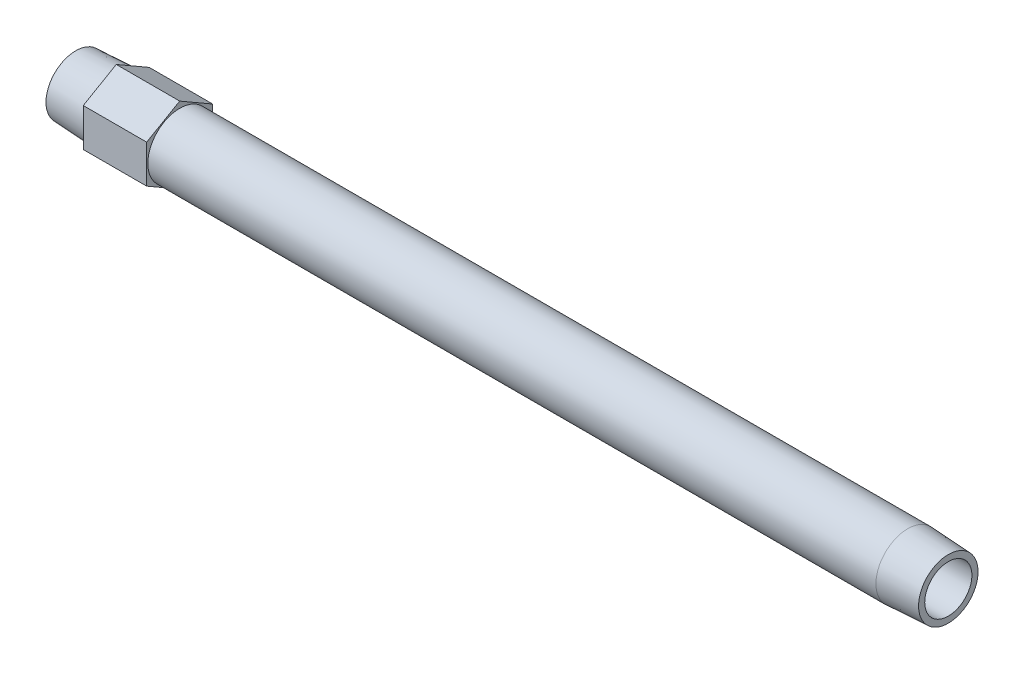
ISO-10303-21;
HEADER;
FILE_DESCRIPTION(('STEP AP214'),'2;1');
FILE_NAME('part.step','',(''),(''),'','','');
FILE_SCHEMA(('AUTOMOTIVE_DESIGN { 1 0 10303 214 1 1 1 1 }'));
ENDSEC;
DATA;
#1=APPLICATION_CONTEXT('core data for automotive mechanical design processes');
#2=APPLICATION_PROTOCOL_DEFINITION('international standard','automotive_design',2000,#1);
#3=PRODUCT_CONTEXT('',#1,'mechanical');
#4=PRODUCT('Part','Part','',(#3));
#5=PRODUCT_RELATED_PRODUCT_CATEGORY('part','',(#4));
#6=PRODUCT_DEFINITION_FORMATION('','',#4);
#7=PRODUCT_DEFINITION_CONTEXT('part definition',#1,'design');
#8=PRODUCT_DEFINITION('design','',#6,#7);
#9=PRODUCT_DEFINITION_SHAPE('','',#8);
#10=(LENGTH_UNIT() NAMED_UNIT(*) SI_UNIT(.MILLI.,.METRE.));
#11=(NAMED_UNIT(*) PLANE_ANGLE_UNIT() SI_UNIT($,.RADIAN.));
#12=(NAMED_UNIT(*) SI_UNIT($,.STERADIAN.) SOLID_ANGLE_UNIT());
#13=UNCERTAINTY_MEASURE_WITH_UNIT(LENGTH_MEASURE(1.E-05),#10,'distance_accuracy_value','');
#14=(GEOMETRIC_REPRESENTATION_CONTEXT(3) GLOBAL_UNCERTAINTY_ASSIGNED_CONTEXT((#13)) GLOBAL_UNIT_ASSIGNED_CONTEXT((#10,
#11,#12)) REPRESENTATION_CONTEXT('',''));
#15=CARTESIAN_POINT('',(0.,0.,0.));
#16=DIRECTION('',(0.,0.,1.));
#17=DIRECTION('',(1.,0.,0.));
#18=AXIS2_PLACEMENT_3D('',#15,#16,#17);
#19=CARTESIAN_POINT('',(0.,0.,-9.95716184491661));
#20=DIRECTION('',(1.,0.,0.));
#21=DIRECTION('',(0.,0.,-1.));
#22=AXIS2_PLACEMENT_3D('',#19,#20,#21);
#23=PLANE('',#22);
#24=CARTESIAN_POINT('',(0.,0.,0.));
#25=DIRECTION('',(-1.,0.,0.));
#26=DIRECTION('',(0.,0.,1.));
#27=AXIS2_PLACEMENT_3D('',#24,#25,#26);
#28=CIRCLE('',#27,9.95716184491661);
#29=CARTESIAN_POINT('',(0.,0.,9.95716184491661));
#30=VERTEX_POINT('',#29);
#31=EDGE_CURVE('E147',#30,#30,#28,.T.);
#32=ORIENTED_EDGE('',*,*,#31,.T.);
#33=EDGE_LOOP('',(#32));
#34=FACE_BOUND('',#33,.T.);
#35=CARTESIAN_POINT('',(0.,0.,0.));
#36=DIRECTION('',(1.,0.,0.));
#37=DIRECTION('',(0.,0.,1.));
#38=AXIS2_PLACEMENT_3D('',#35,#36,#37);
#39=CIRCLE('',#38,7.8994);
#40=CARTESIAN_POINT('',(0.,0.,7.8994));
#41=VERTEX_POINT('',#40);
#42=EDGE_CURVE('E159',#41,#41,#39,.T.);
#43=ORIENTED_EDGE('',*,*,#42,.T.);
#44=EDGE_LOOP('',(#43));
#45=FACE_BOUND('',#44,.T.);
#46=ADVANCED_FACE('F15',(#34,#45),#23,.F.);
#47=CARTESIAN_POINT('',(292.1,0.,-9.95716184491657));
#48=DIRECTION('',(-1.,0.,0.));
#49=DIRECTION('',(0.,0.,1.));
#50=AXIS2_PLACEMENT_3D('',#47,#48,#49);
#51=PLANE('',#50);
#52=CARTESIAN_POINT('',(292.1,0.,0.));
#53=DIRECTION('',(-1.,0.,0.));
#54=DIRECTION('',(0.,0.,1.));
#55=AXIS2_PLACEMENT_3D('',#52,#53,#54);
#56=CIRCLE('',#55,9.95716184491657);
#57=CARTESIAN_POINT('',(292.1,0.,9.95716184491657));
#58=VERTEX_POINT('',#57);
#59=EDGE_CURVE('E150',#58,#58,#56,.T.);
#60=ORIENTED_EDGE('',*,*,#59,.F.);
#61=EDGE_LOOP('',(#60));
#62=FACE_BOUND('',#61,.T.);
#63=CARTESIAN_POINT('',(292.1,0.,0.));
#64=DIRECTION('',(-1.,0.,0.));
#65=DIRECTION('',(0.,0.,1.));
#66=AXIS2_PLACEMENT_3D('',#63,#64,#65);
#67=CIRCLE('',#66,7.8994);
#68=CARTESIAN_POINT('',(292.1,0.,7.8994));
#69=VERTEX_POINT('',#68);
#70=EDGE_CURVE('E156',#69,#69,#67,.F.);
#71=ORIENTED_EDGE('',*,*,#70,.F.);
#72=EDGE_LOOP('',(#71));
#73=FACE_BOUND('',#72,.T.);
#74=ADVANCED_FACE('F178',(#62,#73),#51,.F.);
#75=CARTESIAN_POINT('',(34.798,-6.37914312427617,-11.049));
#76=DIRECTION('',(1.,0.,0.));
#77=DIRECTION('',(0.,1.,0.));
#78=AXIS2_PLACEMENT_3D('',#75,#76,#77);
#79=PLANE('',#78);
#80=DIRECTION('',(0.,0.5,-0.866025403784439));
#81=VECTOR('',#80,1.);
#82=CARTESIAN_POINT('',(34.798,-12.7582862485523,0.));
#83=LINE('',#82,#81);
#84=CARTESIAN_POINT('',(34.798,-12.7582862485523,0.));
#85=VERTEX_POINT('',#84);
#86=CARTESIAN_POINT('',(34.798,-6.37914312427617,-11.049));
#87=VERTEX_POINT('',#86);
#88=EDGE_CURVE('E103',#85,#87,#83,.T.);
#89=ORIENTED_EDGE('',*,*,#88,.T.);
#90=DIRECTION('',(0.,1.,0.));
#91=VECTOR('',#90,1.);
#92=CARTESIAN_POINT('',(34.798,-6.37914312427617,-11.049));
#93=LINE('',#92,#91);
#94=CARTESIAN_POINT('',(34.798,6.37914312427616,-11.049));
#95=VERTEX_POINT('',#94);
#96=EDGE_CURVE('E83',#87,#95,#93,.T.);
#97=ORIENTED_EDGE('',*,*,#96,.T.);
#98=DIRECTION('',(0.,0.5,0.866025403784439));
#99=VECTOR('',#98,1.);
#100=CARTESIAN_POINT('',(34.798,6.37914312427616,-11.049));
#101=LINE('',#100,#99);
#102=CARTESIAN_POINT('',(34.798,12.7582862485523,0.));
#103=VERTEX_POINT('',#102);
#104=EDGE_CURVE('E102',#95,#103,#101,.T.);
#105=ORIENTED_EDGE('',*,*,#104,.T.);
#106=DIRECTION('',(0.,-0.5,0.866025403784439));
#107=VECTOR('',#106,1.);
#108=CARTESIAN_POINT('',(34.798,12.7582862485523,0.));
#109=LINE('',#108,#107);
#110=CARTESIAN_POINT('',(34.798,6.37914312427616,11.049));
#111=VERTEX_POINT('',#110);
#112=EDGE_CURVE('E105',#103,#111,#109,.T.);
#113=ORIENTED_EDGE('',*,*,#112,.T.);
#114=DIRECTION('',(0.,-1.,0.));
#115=VECTOR('',#114,1.);
#116=CARTESIAN_POINT('',(34.798,6.37914312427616,11.049));
#117=LINE('',#116,#115);
#118=CARTESIAN_POINT('',(34.798,-6.37914312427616,11.049));
#119=VERTEX_POINT('',#118);
#120=EDGE_CURVE('E35',#111,#119,#117,.T.);
#121=ORIENTED_EDGE('',*,*,#120,.T.);
#122=DIRECTION('',(0.,-0.5,-0.866025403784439));
#123=VECTOR('',#122,1.);
#124=CARTESIAN_POINT('',(34.798,-6.37914312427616,11.049));
#125=LINE('',#124,#123);
#126=EDGE_CURVE('E30',#119,#85,#125,.T.);
#127=ORIENTED_EDGE('',*,*,#126,.T.);
#128=EDGE_LOOP('',(#89,#97,#105,#113,#121,#127));
#129=FACE_BOUND('',#128,.T.);
#130=CARTESIAN_POINT('',(34.798,0.,0.));
#131=DIRECTION('',(1.,0.,0.));
#132=DIRECTION('',(0.,1.,0.));
#133=AXIS2_PLACEMENT_3D('',#130,#131,#132);
#134=CIRCLE('',#133,10.668);
#135=CARTESIAN_POINT('',(34.798,10.668,0.));
#136=VERTEX_POINT('',#135);
#137=EDGE_CURVE('E89',#136,#136,#134,.F.);
#138=ORIENTED_EDGE('',*,*,#137,.T.);
#139=EDGE_LOOP('',(#138));
#140=FACE_BOUND('',#139,.T.);
#141=ADVANCED_FACE('F124',(#129,#140),#79,.T.);
#142=CARTESIAN_POINT('',(13.5636,-6.37914312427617,-11.049));
#143=DIRECTION('',(1.,0.,0.));
#144=DIRECTION('',(0.,1.,0.));
#145=AXIS2_PLACEMENT_3D('',#142,#143,#144);
#146=PLANE('',#145);
#147=DIRECTION('',(0.,0.5,-0.866025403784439));
#148=VECTOR('',#147,1.);
#149=CARTESIAN_POINT('',(13.5636,-12.7582862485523,0.));
#150=LINE('',#149,#148);
#151=CARTESIAN_POINT('',(13.5636,-12.7582862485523,0.));
#152=VERTEX_POINT('',#151);
#153=CARTESIAN_POINT('',(13.5636,-6.37914312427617,-11.049));
#154=VERTEX_POINT('',#153);
#155=EDGE_CURVE('E73',#152,#154,#150,.T.);
#156=ORIENTED_EDGE('',*,*,#155,.F.);
#157=DIRECTION('',(0.,-0.5,-0.866025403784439));
#158=VECTOR('',#157,1.);
#159=CARTESIAN_POINT('',(13.5636,-6.37914312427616,11.049));
#160=LINE('',#159,#158);
#161=CARTESIAN_POINT('',(13.5636,-6.37914312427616,11.049));
#162=VERTEX_POINT('',#161);
#163=EDGE_CURVE('E99',#162,#152,#160,.T.);
#164=ORIENTED_EDGE('',*,*,#163,.F.);
#165=DIRECTION('',(0.,-1.,0.));
#166=VECTOR('',#165,1.);
#167=CARTESIAN_POINT('',(13.5636,6.37914312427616,11.049));
#168=LINE('',#167,#166);
#169=CARTESIAN_POINT('',(13.5636,6.37914312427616,11.049));
#170=VERTEX_POINT('',#169);
#171=EDGE_CURVE('E133',#170,#162,#168,.T.);
#172=ORIENTED_EDGE('',*,*,#171,.F.);
#173=DIRECTION('',(0.,-0.5,0.866025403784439));
#174=VECTOR('',#173,1.);
#175=CARTESIAN_POINT('',(13.5636,12.7582862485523,0.));
#176=LINE('',#175,#174);
#177=CARTESIAN_POINT('',(13.5636,12.7582862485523,0.));
#178=VERTEX_POINT('',#177);
#179=EDGE_CURVE('E129',#178,#170,#176,.T.);
#180=ORIENTED_EDGE('',*,*,#179,.F.);
#181=DIRECTION('',(0.,0.5,0.866025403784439));
#182=VECTOR('',#181,1.);
#183=CARTESIAN_POINT('',(13.5636,6.37914312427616,-11.049));
#184=LINE('',#183,#182);
#185=CARTESIAN_POINT('',(13.5636,6.37914312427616,-11.049));
#186=VERTEX_POINT('',#185);
#187=EDGE_CURVE('E75',#186,#178,#184,.T.);
#188=ORIENTED_EDGE('',*,*,#187,.F.);
#189=DIRECTION('',(0.,1.,0.));
#190=VECTOR('',#189,1.);
#191=CARTESIAN_POINT('',(13.5636,-6.37914312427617,-11.049));
#192=LINE('',#191,#190);
#193=EDGE_CURVE('E68',#154,#186,#192,.T.);
#194=ORIENTED_EDGE('',*,*,#193,.F.);
#195=EDGE_LOOP('',(#156,#164,#172,#180,#188,#194));
#196=FACE_BOUND('',#195,.T.);
#197=CARTESIAN_POINT('',(13.5636,0.,0.));
#198=DIRECTION('',(-1.,0.,0.));
#199=DIRECTION('',(0.,0.,1.));
#200=AXIS2_PLACEMENT_3D('',#197,#198,#199);
#201=CIRCLE('',#200,10.668);
#202=CARTESIAN_POINT('',(13.5636,0.,10.668));
#203=VERTEX_POINT('',#202);
#204=EDGE_CURVE('E95',#203,#203,#201,.T.);
#205=ORIENTED_EDGE('',*,*,#204,.F.);
#206=EDGE_LOOP('',(#205));
#207=FACE_BOUND('',#206,.T.);
#208=ADVANCED_FACE('F69',(#196,#207),#146,.F.);
#209=CARTESIAN_POINT('',(34.798,-12.7582862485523,0.));
#210=DIRECTION('',(0.,0.866025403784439,0.5));
#211=DIRECTION('',(0.,-0.5,0.866025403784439));
#212=AXIS2_PLACEMENT_3D('',#209,#210,#211);
#213=PLANE('',#212);
#214=ORIENTED_EDGE('',*,*,#155,.T.);
#215=DIRECTION('',(-1.,0.,0.));
#216=VECTOR('',#215,1.);
#217=CARTESIAN_POINT('',(34.798,-6.37914312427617,-11.049));
#218=LINE('',#217,#216);
#219=EDGE_CURVE('E10',#87,#154,#218,.T.);
#220=ORIENTED_EDGE('',*,*,#219,.F.);
#221=ORIENTED_EDGE('',*,*,#88,.F.);
#222=DIRECTION('',(-1.,0.,0.));
#223=VECTOR('',#222,1.);
#224=CARTESIAN_POINT('',(34.798,-12.7582862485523,0.));
#225=LINE('',#224,#223);
#226=EDGE_CURVE('E87',#85,#152,#225,.T.);
#227=ORIENTED_EDGE('',*,*,#226,.T.);
#228=EDGE_LOOP('',(#214,#220,#221,#227));
#229=FACE_BOUND('',#228,.T.);
#230=ADVANCED_FACE('F17',(#229),#213,.F.);
#231=CARTESIAN_POINT('',(34.798,-6.37914312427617,-11.049));
#232=DIRECTION('',(0.,0.,1.));
#233=DIRECTION('',(1.,0.,0.));
#234=AXIS2_PLACEMENT_3D('',#231,#232,#233);
#235=PLANE('',#234);
#236=ORIENTED_EDGE('',*,*,#193,.T.);
#237=DIRECTION('',(-1.,0.,0.));
#238=VECTOR('',#237,1.);
#239=CARTESIAN_POINT('',(34.798,6.37914312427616,-11.049));
#240=LINE('',#239,#238);
#241=EDGE_CURVE('E23',#95,#186,#240,.T.);
#242=ORIENTED_EDGE('',*,*,#241,.F.);
#243=ORIENTED_EDGE('',*,*,#96,.F.);
#244=ORIENTED_EDGE('',*,*,#219,.T.);
#245=EDGE_LOOP('',(#236,#242,#243,#244));
#246=FACE_BOUND('',#245,.T.);
#247=ADVANCED_FACE('F82',(#246),#235,.F.);
#248=CARTESIAN_POINT('',(34.798,6.37914312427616,-11.049));
#249=DIRECTION('',(0.,-0.866025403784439,0.5));
#250=DIRECTION('',(0.,-0.5,-0.866025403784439));
#251=AXIS2_PLACEMENT_3D('',#248,#249,#250);
#252=PLANE('',#251);
#253=ORIENTED_EDGE('',*,*,#187,.T.);
#254=DIRECTION('',(-1.,0.,0.));
#255=VECTOR('',#254,1.);
#256=CARTESIAN_POINT('',(34.798,12.7582862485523,0.));
#257=LINE('',#256,#255);
#258=EDGE_CURVE('E117',#103,#178,#257,.T.);
#259=ORIENTED_EDGE('',*,*,#258,.F.);
#260=ORIENTED_EDGE('',*,*,#104,.F.);
#261=ORIENTED_EDGE('',*,*,#241,.T.);
#262=EDGE_LOOP('',(#253,#259,#260,#261));
#263=FACE_BOUND('',#262,.T.);
#264=ADVANCED_FACE('F121',(#263),#252,.F.);
#265=CARTESIAN_POINT('',(34.798,12.7582862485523,0.));
#266=DIRECTION('',(0.,-0.866025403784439,-0.5));
#267=DIRECTION('',(0.,0.5,-0.866025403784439));
#268=AXIS2_PLACEMENT_3D('',#265,#266,#267);
#269=PLANE('',#268);
#270=ORIENTED_EDGE('',*,*,#179,.T.);
#271=DIRECTION('',(-1.,0.,0.));
#272=VECTOR('',#271,1.);
#273=CARTESIAN_POINT('',(34.798,6.37914312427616,11.049));
#274=LINE('',#273,#272);
#275=EDGE_CURVE('E114',#111,#170,#274,.T.);
#276=ORIENTED_EDGE('',*,*,#275,.F.);
#277=ORIENTED_EDGE('',*,*,#112,.F.);
#278=ORIENTED_EDGE('',*,*,#258,.T.);
#279=EDGE_LOOP('',(#270,#276,#277,#278));
#280=FACE_BOUND('',#279,.T.);
#281=ADVANCED_FACE('F128',(#280),#269,.F.);
#282=CARTESIAN_POINT('',(34.798,6.37914312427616,11.049));
#283=DIRECTION('',(0.,0.,-1.));
#284=DIRECTION('',(-1.,0.,0.));
#285=AXIS2_PLACEMENT_3D('',#282,#283,#284);
#286=PLANE('',#285);
#287=ORIENTED_EDGE('',*,*,#171,.T.);
#288=DIRECTION('',(-1.,0.,0.));
#289=VECTOR('',#288,1.);
#290=CARTESIAN_POINT('',(34.798,-6.37914312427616,11.049));
#291=LINE('',#290,#289);
#292=EDGE_CURVE('E111',#119,#162,#291,.T.);
#293=ORIENTED_EDGE('',*,*,#292,.F.);
#294=ORIENTED_EDGE('',*,*,#120,.F.);
#295=ORIENTED_EDGE('',*,*,#275,.T.);
#296=EDGE_LOOP('',(#287,#293,#294,#295));
#297=FACE_BOUND('',#296,.T.);
#298=ADVANCED_FACE('F132',(#297),#286,.F.);
#299=CARTESIAN_POINT('',(34.798,-6.37914312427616,11.049));
#300=DIRECTION('',(0.,0.866025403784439,-0.5));
#301=DIRECTION('',(0.,0.5,0.866025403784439));
#302=AXIS2_PLACEMENT_3D('',#299,#300,#301);
#303=PLANE('',#302);
#304=ORIENTED_EDGE('',*,*,#163,.T.);
#305=ORIENTED_EDGE('',*,*,#226,.F.);
#306=ORIENTED_EDGE('',*,*,#126,.F.);
#307=ORIENTED_EDGE('',*,*,#292,.T.);
#308=EDGE_LOOP('',(#304,#305,#306,#307));
#309=FACE_BOUND('',#308,.T.);
#310=ADVANCED_FACE('F135',(#309),#303,.F.);
#311=CARTESIAN_POINT('',(13.5636,0.,0.));
#312=DIRECTION('',(1.,0.,0.));
#313=DIRECTION('',(0.,0.,-1.));
#314=AXIS2_PLACEMENT_3D('',#311,#312,#313);
#315=CONICAL_SURFACE('',#314,10.668,0.0523598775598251);
#316=ORIENTED_EDGE('',*,*,#31,.F.);
#317=EDGE_LOOP('',(#316));
#318=FACE_BOUND('',#317,.T.);
#319=ORIENTED_EDGE('',*,*,#204,.T.);
#320=EDGE_LOOP('',(#319));
#321=FACE_BOUND('',#320,.T.);
#322=ADVANCED_FACE('F187',(#318,#321),#315,.T.);
#323=CARTESIAN_POINT('',(-60.,0.,0.));
#324=DIRECTION('',(-1.,0.,0.));
#325=DIRECTION('',(0.,0.,1.));
#326=AXIS2_PLACEMENT_3D('',#323,#324,#325);
#327=CYLINDRICAL_SURFACE('',#326,10.668);
#328=ORIENTED_EDGE('',*,*,#137,.F.);
#329=EDGE_LOOP('',(#328));
#330=FACE_BOUND('',#329,.T.);
#331=CARTESIAN_POINT('',(278.5364,0.,0.));
#332=DIRECTION('',(-1.,0.,0.));
#333=DIRECTION('',(0.,0.,1.));
#334=AXIS2_PLACEMENT_3D('',#331,#332,#333);
#335=CIRCLE('',#334,10.668);
#336=CARTESIAN_POINT('',(278.5364,0.,10.668));
#337=VERTEX_POINT('',#336);
#338=EDGE_CURVE('E153',#337,#337,#335,.T.);
#339=ORIENTED_EDGE('',*,*,#338,.T.);
#340=EDGE_LOOP('',(#339));
#341=FACE_BOUND('',#340,.T.);
#342=ADVANCED_FACE('F174',(#330,#341),#327,.T.);
#343=CARTESIAN_POINT('',(292.1,0.,0.));
#344=DIRECTION('',(-1.,0.,0.));
#345=DIRECTION('',(0.,0.,1.));
#346=AXIS2_PLACEMENT_3D('',#343,#344,#345);
#347=CONICAL_SURFACE('',#346,9.95716184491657,0.052359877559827);
#348=ORIENTED_EDGE('',*,*,#338,.F.);
#349=EDGE_LOOP('',(#348));
#350=FACE_BOUND('',#349,.T.);
#351=ORIENTED_EDGE('',*,*,#59,.T.);
#352=EDGE_LOOP('',(#351));
#353=FACE_BOUND('',#352,.T.);
#354=ADVANCED_FACE('F167',(#350,#353),#347,.T.);
#355=CARTESIAN_POINT('',(294.043920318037,0.,0.));
#356=DIRECTION('',(-1.,0.,0.));
#357=DIRECTION('',(0.,0.,1.));
#358=AXIS2_PLACEMENT_3D('',#355,#356,#357);
#359=CYLINDRICAL_SURFACE('',#358,7.8994);
#360=ORIENTED_EDGE('',*,*,#70,.T.);
#361=EDGE_LOOP('',(#360));
#362=FACE_BOUND('',#361,.T.);
#363=ORIENTED_EDGE('',*,*,#42,.F.);
#364=EDGE_LOOP('',(#363));
#365=FACE_BOUND('',#364,.T.);
#366=ADVANCED_FACE('F165',(#362,#365),#359,.F.);
#367=CLOSED_SHELL('',(#46,#74,#141,#208,#230,#247,#264,#281,#298,#310,#322,#342,#354,#366));
#368=MANIFOLD_SOLID_BREP('B1',#367);
#369=ADVANCED_BREP_SHAPE_REPRESENTATION('',(#18,#368),#14);
#370=SHAPE_DEFINITION_REPRESENTATION(#9,#369);
ENDSEC;
END-ISO-10303-21;
